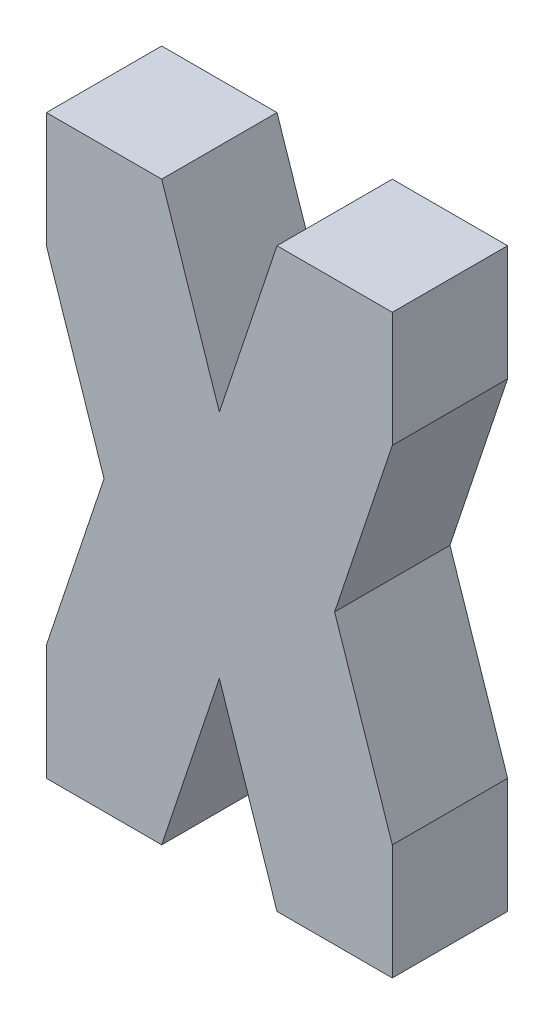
from build123d import *

# Parameters (mm, degrees)
BOSS_EXTRU_1_DEPTH = 10


with BuildPart() as part:
    # Esquisse1 → Boss.-Extru.1 (new body)
    with BuildSketch(Plane.XY):
        Polygon((10, 50), (15, 35), (20, 50), (30, 50), (30, 40), (25, 25), (30, 10), (30, 0), (20, 0), (15, 15), (10, 0), (0, 0), (0, 10), (5, 25), (0, 40), (0, 50), align=None)
    extrude(amount=BOSS_EXTRU_1_DEPTH)


solid = part.part
